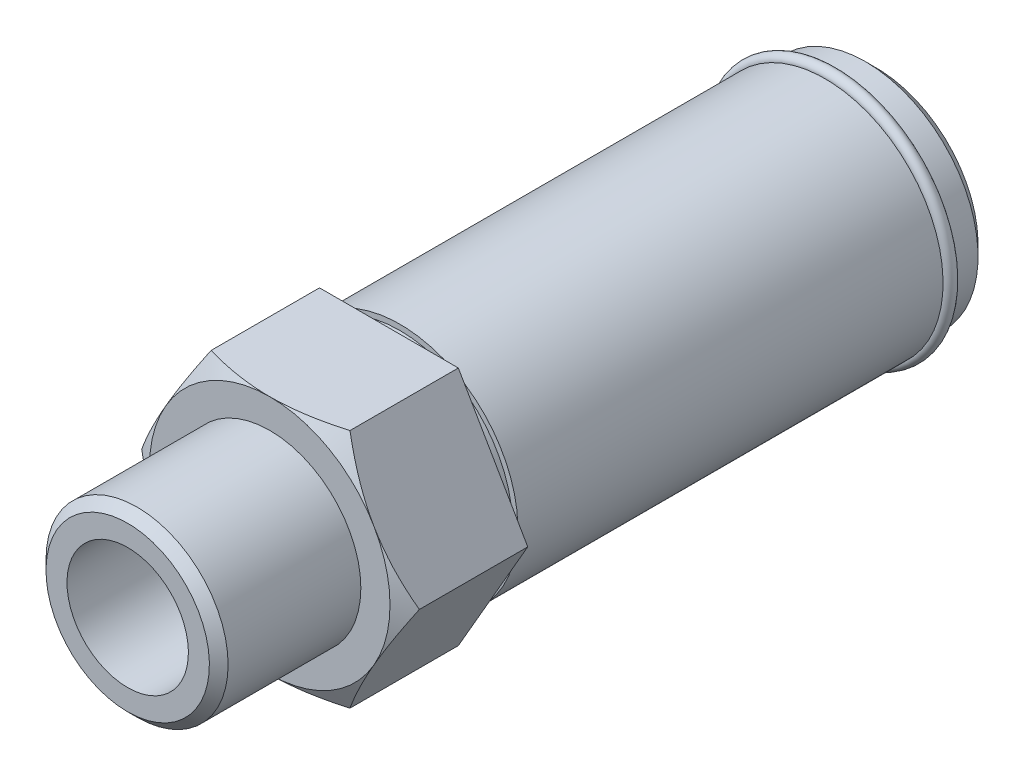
ISO-10303-21;
HEADER;
FILE_DESCRIPTION(('STEP AP214'),'2;1');
FILE_NAME('part.step','',(''),(''),'','','');
FILE_SCHEMA(('AUTOMOTIVE_DESIGN { 1 0 10303 214 1 1 1 1 }'));
ENDSEC;
DATA;
#1=APPLICATION_CONTEXT('core data for automotive mechanical design processes');
#2=APPLICATION_PROTOCOL_DEFINITION('international standard','automotive_design',2000,#1);
#3=PRODUCT_CONTEXT('',#1,'mechanical');
#4=PRODUCT('Part','Part','',(#3));
#5=PRODUCT_RELATED_PRODUCT_CATEGORY('part','',(#4));
#6=PRODUCT_DEFINITION_FORMATION('','',#4);
#7=PRODUCT_DEFINITION_CONTEXT('part definition',#1,'design');
#8=PRODUCT_DEFINITION('design','',#6,#7);
#9=PRODUCT_DEFINITION_SHAPE('','',#8);
#10=(LENGTH_UNIT() NAMED_UNIT(*) SI_UNIT(.MILLI.,.METRE.));
#11=(NAMED_UNIT(*) PLANE_ANGLE_UNIT() SI_UNIT($,.RADIAN.));
#12=(NAMED_UNIT(*) SI_UNIT($,.STERADIAN.) SOLID_ANGLE_UNIT());
#13=UNCERTAINTY_MEASURE_WITH_UNIT(LENGTH_MEASURE(1.E-05),#10,'distance_accuracy_value','');
#14=(GEOMETRIC_REPRESENTATION_CONTEXT(3) GLOBAL_UNCERTAINTY_ASSIGNED_CONTEXT((#13)) GLOBAL_UNIT_ASSIGNED_CONTEXT((#10,
#11,#12)) REPRESENTATION_CONTEXT('',''));
#15=CARTESIAN_POINT('',(0.,0.,0.));
#16=DIRECTION('',(0.,0.,1.));
#17=DIRECTION('',(1.,0.,0.));
#18=AXIS2_PLACEMENT_3D('',#15,#16,#17);
#19=CARTESIAN_POINT('',(0.,22.,41.));
#20=DIRECTION('',(0.,0.,1.));
#21=DIRECTION('',(0.,-1.,0.));
#22=AXIS2_PLACEMENT_3D('',#19,#20,#21);
#23=PLANE('',#22);
#24=CARTESIAN_POINT('',(0.,0.,41.));
#25=DIRECTION('',(0.,0.,1.));
#26=DIRECTION('',(0.,-1.,0.));
#27=AXIS2_PLACEMENT_3D('',#24,#25,#26);
#28=CIRCLE('',#27,10.3);
#29=CARTESIAN_POINT('',(0.,-10.3,41.));
#30=VERTEX_POINT('',#29);
#31=EDGE_CURVE('E229',#30,#30,#28,.T.);
#32=ORIENTED_EDGE('',*,*,#31,.T.);
#33=EDGE_LOOP('',(#32));
#34=FACE_BOUND('',#33,.T.);
#35=DIRECTION('',(1.,0.,0.));
#36=VECTOR('',#35,1.);
#37=CARTESIAN_POINT('',(-6.35085296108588,-11.,41.));
#38=LINE('',#37,#36);
#39=CARTESIAN_POINT('',(-6.35085296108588,-11.,41.));
#40=VERTEX_POINT('',#39);
#41=CARTESIAN_POINT('',(6.35085296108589,-11.,41.));
#42=VERTEX_POINT('',#41);
#43=EDGE_CURVE('E62',#40,#42,#38,.T.);
#44=ORIENTED_EDGE('',*,*,#43,.F.);
#45=DIRECTION('',(0.5,-0.866025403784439,0.));
#46=VECTOR('',#45,1.);
#47=CARTESIAN_POINT('',(-12.7017059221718,0.,41.));
#48=LINE('',#47,#46);
#49=CARTESIAN_POINT('',(-12.7017059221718,0.,41.));
#50=VERTEX_POINT('',#49);
#51=EDGE_CURVE('E138',#50,#40,#48,.T.);
#52=ORIENTED_EDGE('',*,*,#51,.F.);
#53=DIRECTION('',(-0.5,-0.866025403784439,0.));
#54=VECTOR('',#53,1.);
#55=CARTESIAN_POINT('',(-6.35085296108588,11.,41.));
#56=LINE('',#55,#54);
#57=CARTESIAN_POINT('',(-6.35085296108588,11.,41.));
#58=VERTEX_POINT('',#57);
#59=EDGE_CURVE('E136',#58,#50,#56,.T.);
#60=ORIENTED_EDGE('',*,*,#59,.F.);
#61=DIRECTION('',(-1.,0.,0.));
#62=VECTOR('',#61,1.);
#63=CARTESIAN_POINT('',(6.35085296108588,11.,41.));
#64=LINE('',#63,#62);
#65=CARTESIAN_POINT('',(6.35085296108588,11.,41.));
#66=VERTEX_POINT('',#65);
#67=EDGE_CURVE('E117',#66,#58,#64,.T.);
#68=ORIENTED_EDGE('',*,*,#67,.F.);
#69=DIRECTION('',(-0.5,0.866025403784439,0.));
#70=VECTOR('',#69,1.);
#71=CARTESIAN_POINT('',(12.7017059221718,0.,41.));
#72=LINE('',#71,#70);
#73=CARTESIAN_POINT('',(12.7017059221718,0.,41.));
#74=VERTEX_POINT('',#73);
#75=EDGE_CURVE('E127',#74,#66,#72,.T.);
#76=ORIENTED_EDGE('',*,*,#75,.F.);
#77=DIRECTION('',(0.5,0.866025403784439,0.));
#78=VECTOR('',#77,1.);
#79=CARTESIAN_POINT('',(6.35085296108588,-11.,41.));
#80=LINE('',#79,#78);
#81=EDGE_CURVE('E132',#42,#74,#80,.T.);
#82=ORIENTED_EDGE('',*,*,#81,.F.);
#83=EDGE_LOOP('',(#44,#52,#60,#68,#76,#82));
#84=FACE_BOUND('',#83,.T.);
#85=ADVANCED_FACE('F39',(#34,#84),#23,.F.);
#86=CARTESIAN_POINT('',(0.,0.,-3.59999999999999));
#87=DIRECTION('',(0.,0.,1.));
#88=DIRECTION('',(0.,-1.,0.));
#89=AXIS2_PLACEMENT_3D('',#86,#87,#88);
#90=CYLINDRICAL_SURFACE('',#89,10.3);
#91=ORIENTED_EDGE('',*,*,#31,.F.);
#92=EDGE_LOOP('',(#91));
#93=FACE_BOUND('',#92,.T.);
#94=CARTESIAN_POINT('',(0.,0.,40.));
#95=DIRECTION('',(0.,0.,1.));
#96=DIRECTION('',(0.,-1.,0.));
#97=AXIS2_PLACEMENT_3D('',#94,#95,#96);
#98=CIRCLE('',#97,10.3);
#99=CARTESIAN_POINT('',(0.,-10.3,40.));
#100=VERTEX_POINT('',#99);
#101=EDGE_CURVE('E226',#100,#100,#98,.T.);
#102=ORIENTED_EDGE('',*,*,#101,.T.);
#103=EDGE_LOOP('',(#102));
#104=FACE_BOUND('',#103,.T.);
#105=ADVANCED_FACE('F326',(#93,#104),#90,.T.);
#106=CARTESIAN_POINT('',(0.,10.3,40.));
#107=DIRECTION('',(0.,0.,-1.));
#108=DIRECTION('',(0.,1.,0.));
#109=AXIS2_PLACEMENT_3D('',#106,#107,#108);
#110=PLANE('',#109);
#111=ORIENTED_EDGE('',*,*,#101,.F.);
#112=EDGE_LOOP('',(#111));
#113=FACE_BOUND('',#112,.T.);
#114=CARTESIAN_POINT('',(0.,0.,40.));
#115=DIRECTION('',(0.,0.,1.));
#116=DIRECTION('',(0.,-1.,0.));
#117=AXIS2_PLACEMENT_3D('',#114,#115,#116);
#118=CIRCLE('',#117,10.8);
#119=CARTESIAN_POINT('',(0.,-10.8,40.));
#120=VERTEX_POINT('',#119);
#121=EDGE_CURVE('E223',#120,#120,#118,.T.);
#122=ORIENTED_EDGE('',*,*,#121,.T.);
#123=EDGE_LOOP('',(#122));
#124=FACE_BOUND('',#123,.T.);
#125=ADVANCED_FACE('F331',(#113,#124),#110,.F.);
#126=CARTESIAN_POINT('',(0.,0.,-3.59999999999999));
#127=DIRECTION('',(0.,0.,1.));
#128=DIRECTION('',(0.,-1.,0.));
#129=AXIS2_PLACEMENT_3D('',#126,#127,#128);
#130=CYLINDRICAL_SURFACE('',#129,10.8);
#131=ORIENTED_EDGE('',*,*,#121,.F.);
#132=EDGE_LOOP('',(#131));
#133=FACE_BOUND('',#132,.T.);
#134=CARTESIAN_POINT('',(0.,0.,1.09963624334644));
#135=DIRECTION('',(0.,0.,1.));
#136=DIRECTION('',(0.,-1.,0.));
#137=AXIS2_PLACEMENT_3D('',#134,#135,#136);
#138=CIRCLE('',#137,10.8);
#139=CARTESIAN_POINT('',(0.,-10.8,1.09963624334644));
#140=VERTEX_POINT('',#139);
#141=EDGE_CURVE('E220',#140,#140,#138,.T.);
#142=ORIENTED_EDGE('',*,*,#141,.T.);
#143=EDGE_LOOP('',(#142));
#144=FACE_BOUND('',#143,.T.);
#145=ADVANCED_FACE('F337',(#133,#144),#130,.T.);
#146=CARTESIAN_POINT('',(0.,0.,0.549999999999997));
#147=DIRECTION('',(0.,0.,1.));
#148=DIRECTION('',(0.,-1.,0.));
#149=AXIS2_PLACEMENT_3D('',#146,#147,#148);
#150=TOROIDAL_SURFACE('',#149,10.8200000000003,0.55);
#151=ORIENTED_EDGE('',*,*,#141,.F.);
#152=EDGE_LOOP('',(#151));
#153=FACE_BOUND('',#152,.T.);
#154=CARTESIAN_POINT('',(0.,0.,0.));
#155=DIRECTION('',(0.,0.,1.));
#156=DIRECTION('',(0.,-1.,0.));
#157=AXIS2_PLACEMENT_3D('',#154,#155,#156);
#158=CIRCLE('',#157,10.82);
#159=CARTESIAN_POINT('',(0.,-10.82,0.));
#160=VERTEX_POINT('',#159);
#161=EDGE_CURVE('E217',#160,#160,#158,.T.);
#162=ORIENTED_EDGE('',*,*,#161,.T.);
#163=EDGE_LOOP('',(#162));
#164=FACE_BOUND('',#163,.T.);
#165=ADVANCED_FACE('F341',(#153,#164),#150,.T.);
#166=CARTESIAN_POINT('',(0.,10.82,0.));
#167=DIRECTION('',(0.,0.,1.));
#168=DIRECTION('',(0.,-1.,0.));
#169=AXIS2_PLACEMENT_3D('',#166,#167,#168);
#170=PLANE('',#169);
#171=ORIENTED_EDGE('',*,*,#161,.F.);
#172=EDGE_LOOP('',(#171));
#173=FACE_BOUND('',#172,.T.);
#174=CARTESIAN_POINT('',(0.,0.,0.));
#175=DIRECTION('',(0.,0.,1.));
#176=DIRECTION('',(0.,-1.,0.));
#177=AXIS2_PLACEMENT_3D('',#174,#175,#176);
#178=CIRCLE('',#177,10.3);
#179=CARTESIAN_POINT('',(0.,-10.3,0.));
#180=VERTEX_POINT('',#179);
#181=EDGE_CURVE('E214',#180,#180,#178,.T.);
#182=ORIENTED_EDGE('',*,*,#181,.T.);
#183=EDGE_LOOP('',(#182));
#184=FACE_BOUND('',#183,.T.);
#185=ADVANCED_FACE('F345',(#173,#184),#170,.F.);
#186=CARTESIAN_POINT('',(0.,0.,-3.59999999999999));
#187=DIRECTION('',(0.,0.,1.));
#188=DIRECTION('',(0.,-1.,0.));
#189=AXIS2_PLACEMENT_3D('',#186,#187,#188);
#190=CYLINDRICAL_SURFACE('',#189,10.3);
#191=ORIENTED_EDGE('',*,*,#181,.F.);
#192=EDGE_LOOP('',(#191));
#193=FACE_BOUND('',#192,.T.);
#194=CARTESIAN_POINT('',(0.,0.,-2.6));
#195=DIRECTION('',(0.,0.,1.));
#196=DIRECTION('',(0.,-1.,0.));
#197=AXIS2_PLACEMENT_3D('',#194,#195,#196);
#198=CIRCLE('',#197,10.3);
#199=CARTESIAN_POINT('',(0.,-10.3,-2.6));
#200=VERTEX_POINT('',#199);
#201=EDGE_CURVE('E211',#200,#200,#198,.T.);
#202=ORIENTED_EDGE('',*,*,#201,.T.);
#203=EDGE_LOOP('',(#202));
#204=FACE_BOUND('',#203,.T.);
#205=ADVANCED_FACE('F349',(#193,#204),#190,.T.);
#206=CARTESIAN_POINT('',(0.,0.,-3.6));
#207=DIRECTION('',(0.,0.,1.));
#208=DIRECTION('',(0.,-1.,0.));
#209=AXIS2_PLACEMENT_3D('',#206,#207,#208);
#210=CONICAL_SURFACE('',#209,9.3,0.785398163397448);
#211=ORIENTED_EDGE('',*,*,#201,.F.);
#212=EDGE_LOOP('',(#211));
#213=FACE_BOUND('',#212,.T.);
#214=CARTESIAN_POINT('',(0.,0.,-3.6));
#215=DIRECTION('',(0.,0.,1.));
#216=DIRECTION('',(0.,-1.,0.));
#217=AXIS2_PLACEMENT_3D('',#214,#215,#216);
#218=CIRCLE('',#217,9.3);
#219=CARTESIAN_POINT('',(0.,-9.3,-3.6));
#220=VERTEX_POINT('',#219);
#221=EDGE_CURVE('E208',#220,#220,#218,.T.);
#222=ORIENTED_EDGE('',*,*,#221,.T.);
#223=EDGE_LOOP('',(#222));
#224=FACE_BOUND('',#223,.T.);
#225=ADVANCED_FACE('F353',(#213,#224),#210,.T.);
#226=CARTESIAN_POINT('',(0.,9.3,-3.59999999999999));
#227=DIRECTION('',(0.,0.,1.));
#228=DIRECTION('',(0.,-1.,0.));
#229=AXIS2_PLACEMENT_3D('',#226,#227,#228);
#230=PLANE('',#229);
#231=ORIENTED_EDGE('',*,*,#221,.F.);
#232=EDGE_LOOP('',(#231));
#233=FACE_BOUND('',#232,.T.);
#234=CARTESIAN_POINT('',(0.,0.,-3.6));
#235=DIRECTION('',(0.,0.,1.));
#236=DIRECTION('',(0.,-1.,0.));
#237=AXIS2_PLACEMENT_3D('',#234,#235,#236);
#238=CIRCLE('',#237,8.331);
#239=CARTESIAN_POINT('',(0.,-8.331,-3.6));
#240=VERTEX_POINT('',#239);
#241=EDGE_CURVE('E205',#240,#240,#238,.T.);
#242=ORIENTED_EDGE('',*,*,#241,.T.);
#243=EDGE_LOOP('',(#242));
#244=FACE_BOUND('',#243,.T.);
#245=ADVANCED_FACE('F357',(#233,#244),#230,.F.);
#246=CARTESIAN_POINT('',(0.,0.,-2.744));
#247=DIRECTION('',(0.,0.,-1.));
#248=DIRECTION('',(0.,1.,0.));
#249=AXIS2_PLACEMENT_3D('',#246,#247,#248);
#250=CONICAL_SURFACE('',#249,7.475,0.785398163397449);
#251=ORIENTED_EDGE('',*,*,#241,.F.);
#252=EDGE_LOOP('',(#251));
#253=FACE_BOUND('',#252,.T.);
#254=CARTESIAN_POINT('',(0.,0.,-2.744));
#255=DIRECTION('',(0.,0.,1.));
#256=DIRECTION('',(0.,-1.,0.));
#257=AXIS2_PLACEMENT_3D('',#254,#255,#256);
#258=CIRCLE('',#257,7.475);
#259=CARTESIAN_POINT('',(0.,-7.475,-2.744));
#260=VERTEX_POINT('',#259);
#261=EDGE_CURVE('E202',#260,#260,#258,.T.);
#262=ORIENTED_EDGE('',*,*,#261,.T.);
#263=EDGE_LOOP('',(#262));
#264=FACE_BOUND('',#263,.T.);
#265=ADVANCED_FACE('F361',(#253,#264),#250,.F.);
#266=CARTESIAN_POINT('',(0.,0.,-3.59999999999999));
#267=DIRECTION('',(0.,0.,1.));
#268=DIRECTION('',(0.,-1.,0.));
#269=AXIS2_PLACEMENT_3D('',#266,#267,#268);
#270=CYLINDRICAL_SURFACE('',#269,7.475);
#271=ORIENTED_EDGE('',*,*,#261,.F.);
#272=EDGE_LOOP('',(#271));
#273=FACE_BOUND('',#272,.T.);
#274=CARTESIAN_POINT('',(0.,0.,9.3));
#275=DIRECTION('',(0.,0.,1.));
#276=DIRECTION('',(0.,-1.,0.));
#277=AXIS2_PLACEMENT_3D('',#274,#275,#276);
#278=CIRCLE('',#277,7.475);
#279=CARTESIAN_POINT('',(0.,-7.475,9.3));
#280=VERTEX_POINT('',#279);
#281=EDGE_CURVE('E199',#280,#280,#278,.T.);
#282=ORIENTED_EDGE('',*,*,#281,.T.);
#283=EDGE_LOOP('',(#282));
#284=FACE_BOUND('',#283,.T.);
#285=ADVANCED_FACE('F364',(#273,#284),#270,.F.);
#286=CARTESIAN_POINT('',(0.,7.475,9.30000000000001));
#287=DIRECTION('',(0.,0.,1.));
#288=DIRECTION('',(0.,-1.,0.));
#289=AXIS2_PLACEMENT_3D('',#286,#287,#288);
#290=PLANE('',#289);
#291=ORIENTED_EDGE('',*,*,#281,.F.);
#292=EDGE_LOOP('',(#291));
#293=FACE_BOUND('',#292,.T.);
#294=ADVANCED_FACE('F182',(#293),#290,.F.);
#295=CARTESIAN_POINT('',(-6.35085296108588,-11.,41.));
#296=DIRECTION('',(0.,-1.,0.));
#297=DIRECTION('',(0.,0.,-1.));
#298=AXIS2_PLACEMENT_3D('',#295,#296,#297);
#299=PLANE('',#298);
#300=CARTESIAN_POINT('',(-17.1494700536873,-11.,46.4878555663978));
#301=CARTESIAN_POINT('',(-16.9088416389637,-11.,46.6047919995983));
#302=CARTESIAN_POINT('',(-16.6679332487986,-11.,46.7211520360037));
#303=CARTESIAN_POINT('',(-16.1854981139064,-11.,46.9525889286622));
#304=CARTESIAN_POINT('',(-15.9439713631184,-11.,47.0676657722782));
#305=CARTESIAN_POINT('',(-15.2183128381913,-11.,47.4108057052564));
#306=CARTESIAN_POINT('',(-14.733172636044,-11.,47.6367441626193));
#307=CARTESIAN_POINT('',(-13.7570787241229,-11.,48.0828025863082));
#308=CARTESIAN_POINT('',(-13.2661077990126,-11.,48.3028849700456));
#309=CARTESIAN_POINT('',(-12.2802921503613,-11.,48.7341645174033));
#310=CARTESIAN_POINT('',(-11.7854476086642,-11.,48.9453620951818));
#311=CARTESIAN_POINT('',(-10.7749198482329,-11.,49.3632128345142));
#312=CARTESIAN_POINT('',(-10.2590823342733,-11.,49.5694947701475));
#313=CARTESIAN_POINT('',(-9.22140262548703,-11.,49.9666647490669));
#314=CARTESIAN_POINT('',(-8.69955976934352,-11.,50.1575510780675));
#315=CARTESIAN_POINT('',(-7.65000312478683,-11.,50.5189828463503));
#316=CARTESIAN_POINT('',(-7.12230334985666,-11.,50.6895686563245));
#317=CARTESIAN_POINT('',(-6.05928576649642,-11.,51.0049960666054));
#318=CARTESIAN_POINT('',(-5.52397038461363,-11.,51.1498456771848));
#319=CARTESIAN_POINT('',(-4.71663342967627,-11.,51.3422340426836));
#320=CARTESIAN_POINT('',(-4.44752912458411,-11.,51.4020869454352));
#321=CARTESIAN_POINT('',(-3.90746509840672,-11.,51.5127879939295));
#322=CARTESIAN_POINT('',(-3.63650541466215,-11.,51.5636363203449));
#323=CARTESIAN_POINT('',(-3.09291179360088,-11.,51.6554361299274));
#324=CARTESIAN_POINT('',(-2.82027788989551,-11.,51.6963878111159));
#325=CARTESIAN_POINT('',(-2.27361639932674,-11.,51.7675811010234));
#326=CARTESIAN_POINT('',(-1.99958886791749,-11.,51.797823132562));
#327=CARTESIAN_POINT('',(-1.45414258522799,-11.,51.8466118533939));
#328=CARTESIAN_POINT('',(-1.18273728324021,-11.,51.8653079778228));
#329=CARTESIAN_POINT('',(-0.639379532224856,-11.,51.8912013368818));
#330=CARTESIAN_POINT('',(-0.367427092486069,-11.,51.8983987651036));
#331=CARTESIAN_POINT('',(0.176540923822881,-11.,51.9011231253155));
#332=CARTESIAN_POINT('',(0.448556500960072,-11.,51.8966499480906));
#333=CARTESIAN_POINT('',(0.992154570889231,-11.,51.8761433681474));
#334=CARTESIAN_POINT('',(1.26373704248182,-11.,51.8601094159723));
#335=CARTESIAN_POINT('',(1.91358960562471,-11.,51.8082526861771));
#336=CARTESIAN_POINT('',(2.29144383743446,-11.,51.7671029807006));
#337=CARTESIAN_POINT('',(3.04439020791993,-11.,51.664648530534));
#338=CARTESIAN_POINT('',(3.41948197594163,-11.,51.6033411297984));
#339=CARTESIAN_POINT('',(4.54015051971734,-11.,51.3924298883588));
#340=CARTESIAN_POINT('',(5.28072413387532,-11.,51.2158728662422));
#341=CARTESIAN_POINT('',(6.38844541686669,-11.,50.9091026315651));
#342=CARTESIAN_POINT('',(6.76131876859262,-11.,50.7983711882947));
#343=CARTESIAN_POINT('',(7.50344393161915,-11.,50.5652651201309));
#344=CARTESIAN_POINT('',(7.87269571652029,-11.,50.4428904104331));
#345=CARTESIAN_POINT('',(8.60769467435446,-11.,50.1884734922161));
#346=CARTESIAN_POINT('',(8.97344289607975,-11.,50.0564342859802));
#347=CARTESIAN_POINT('',(9.7018957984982,-11.,49.7842565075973));
#348=CARTESIAN_POINT('',(10.064600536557,-11.,49.6441180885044));
#349=CARTESIAN_POINT('',(11.0027637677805,-11.,49.2715225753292));
#350=CARTESIAN_POINT('',(11.5761433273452,-11.,49.0338371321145));
#351=CARTESIAN_POINT('',(12.7173509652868,-11.,48.5454494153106));
#352=CARTESIAN_POINT('',(13.2851785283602,-11.,48.2947459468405));
#353=CARTESIAN_POINT('',(14.4164848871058,-11.,47.7832633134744));
#354=CARTESIAN_POINT('',(14.9799622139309,-11.,47.52248090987));
#355=CARTESIAN_POINT('',(16.1032173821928,-11.,46.9931380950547));
#356=CARTESIAN_POINT('',(16.6629953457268,-11.,46.724577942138));
#357=CARTESIAN_POINT('',(17.7803426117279,-11.,46.1809169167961));
#358=CARTESIAN_POINT('',(18.3379076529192,-11.,45.9058073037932));
#359=CARTESIAN_POINT('',(19.4505702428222,-11.,45.3506412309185));
#360=CARTESIAN_POINT('',(20.0056677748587,-11.,45.0705847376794));
#361=CARTESIAN_POINT('',(21.1137147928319,-11.,44.5065127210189));
#362=CARTESIAN_POINT('',(21.6666646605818,-11.,44.2224979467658));
#363=CARTESIAN_POINT('',(22.7708591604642,-11.,43.6511708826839));
#364=CARTESIAN_POINT('',(23.3221037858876,-11.,43.3638585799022));
#365=CARTESIAN_POINT('',(24.8650092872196,-11.,42.5548287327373));
#366=CARTESIAN_POINT('',(25.8550645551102,-11.,42.0300495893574));
#367=CARTESIAN_POINT('',(27.8317717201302,-11.,40.9740126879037));
#368=CARTESIAN_POINT('',(28.8184234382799,-11.,40.4427545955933));
#369=CARTESIAN_POINT('',(30.786100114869,-11.,39.3769883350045));
#370=CARTESIAN_POINT('',(31.7671330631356,-11.,38.84249490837));
#371=CARTESIAN_POINT('',(33.237114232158,-11.,38.0379728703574));
#372=CARTESIAN_POINT('',(33.7268298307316,-11.,37.7693444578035));
#373=CARTESIAN_POINT('',(34.7058031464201,-11.,37.2312560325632));
#374=CARTESIAN_POINT('',(35.1950608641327,-11.,36.9617960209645));
#375=CARTESIAN_POINT('',(35.6841170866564,-11.,36.6919707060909));
#376=B_SPLINE_CURVE_WITH_KNOTS('',3,(#300,#301,#302,#303,#304,#305,#306,#307,#308,#309,#310,
#311,#312,#313,#314,#315,#316,#317,#318,#319,#320,#321,#322,#323,#324,#325,#326,#327,#328,#329,
#330,#331,#332,#333,#334,#335,#336,#337,#338,#339,#340,#341,#342,#343,#344,#345,#346,#347,#348,
#349,#350,#351,#352,#353,#354,#355,#356,#357,#358,#359,#360,#361,#362,#363,#364,#365,#366,#367,
#368,#369,#370,#371,#372,#373,#374,#375),.UNSPECIFIED.,.F.,.F.,(4,2,2,2,2,2,2,2,2,2,2,2,2,2,2,2,
2,2,2,2,2,2,2,2,2,2,2,2,2,2,2,2,2,2,2,2,2,4),(0.,0.802610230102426,1.60522835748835,
3.21069768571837,4.82475368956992,6.43873437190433,8.10520960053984,9.7718701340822,
11.4351588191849,13.0979289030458,13.9248428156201,14.7517401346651,15.5786209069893,
16.4054690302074,17.221378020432,18.0372732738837,18.8531761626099,19.6691178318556,
20.8087410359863,21.9485144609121,24.2292499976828,25.3960537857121,26.5628660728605,
27.7293174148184,28.8957467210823,30.7575890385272,32.6196025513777,34.4822194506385,
36.3447745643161,38.2099726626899,40.0751833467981,41.9400456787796,43.8049153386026,
47.166488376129,50.5282355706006,53.8797881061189,55.5554495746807,57.2311088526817),.UNSPECIFIED.);
#377=CARTESIAN_POINT('',(6.35085296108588,-11.,50.9175196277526));
#378=VERTEX_POINT('',#377);
#379=CARTESIAN_POINT('',(0.,-11.,51.9));
#380=VERTEX_POINT('',#379);
#381=EDGE_CURVE('E191',#378,#380,#376,.F.);
#382=ORIENTED_EDGE('',*,*,#381,.T.);
#383=CARTESIAN_POINT('',(-6.35085296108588,-11.,50.9175196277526));
#384=VERTEX_POINT('',#383);
#385=EDGE_CURVE('E185',#380,#384,#376,.F.);
#386=ORIENTED_EDGE('',*,*,#385,.T.);
#387=DIRECTION('',(0.,0.,1.));
#388=VECTOR('',#387,1.);
#389=CARTESIAN_POINT('',(-6.35085296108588,-11.,41.));
#390=LINE('',#389,#388);
#391=EDGE_CURVE('E145',#40,#384,#390,.T.);
#392=ORIENTED_EDGE('',*,*,#391,.F.);
#393=ORIENTED_EDGE('',*,*,#43,.T.);
#394=DIRECTION('',(0.,0.,1.));
#395=VECTOR('',#394,1.);
#396=CARTESIAN_POINT('',(6.35085296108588,-11.,41.));
#397=LINE('',#396,#395);
#398=EDGE_CURVE('E144',#42,#378,#397,.T.);
#399=ORIENTED_EDGE('',*,*,#398,.T.);
#400=EDGE_LOOP('',(#382,#386,#392,#393,#399));
#401=FACE_BOUND('',#400,.T.);
#402=ADVANCED_FACE('F177',(#401),#299,.T.);
#403=CARTESIAN_POINT('',(-12.7017059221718,0.,41.));
#404=DIRECTION('',(-0.866025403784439,-0.5,0.));
#405=DIRECTION('',(0.5,-0.866025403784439,0.));
#406=AXIS2_PLACEMENT_3D('',#403,#404,#405);
#407=PLANE('',#406);
#408=CARTESIAN_POINT('',(-6.35073749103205,-11.0002,50.9174529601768));
#409=CARTESIAN_POINT('',(-6.49034297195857,-10.7583962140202,50.9980408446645));
#410=CARTESIAN_POINT('',(-6.63046897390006,-10.515690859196,51.0749710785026));
#411=CARTESIAN_POINT('',(-6.91184468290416,-10.0283338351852,51.2205013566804));
#412=CARTESIAN_POINT('',(-7.05309474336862,-9.78368155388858,51.2890986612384));
#413=CARTESIAN_POINT('',(-7.47912088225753,-9.0457826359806,51.4810636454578));
#414=CARTESIAN_POINT('',(-7.7655787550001,-8.54962304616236,51.5902522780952));
#415=CARTESIAN_POINT('',(-8.19424982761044,-7.80714296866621,51.7182858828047));
#416=CARTESIAN_POINT('',(-8.33518236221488,-7.56304065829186,51.7547577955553));
#417=CARTESIAN_POINT('',(-8.61769996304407,-7.07370581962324,51.815918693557));
#418=CARTESIAN_POINT('',(-8.75928504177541,-6.82847326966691,51.8406074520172));
#419=CARTESIAN_POINT('',(-9.04269125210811,-6.33759931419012,51.8775696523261));
#420=CARTESIAN_POINT('',(-9.18451190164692,-6.09195874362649,51.8898578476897));
#421=CARTESIAN_POINT('',(-9.468284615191,-5.60044998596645,51.9017570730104));
#422=CARTESIAN_POINT('',(-9.61023667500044,-5.35458180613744,51.9013684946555));
#423=CARTESIAN_POINT('',(-9.87561687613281,-4.89492981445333,51.8887988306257));
#424=CARTESIAN_POINT('',(-9.99906394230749,-4.68111322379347,51.8781509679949));
#425=CARTESIAN_POINT('',(-10.2456741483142,-4.25397181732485,51.8474683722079));
#426=CARTESIAN_POINT('',(-10.3688372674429,-4.04064703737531,51.8274329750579));
#427=CARTESIAN_POINT('',(-10.6148126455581,-3.6146051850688,51.7783246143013));
#428=CARTESIAN_POINT('',(-10.7376245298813,-3.4018887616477,51.749244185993));
#429=CARTESIAN_POINT('',(-10.9826725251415,-2.97745318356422,51.6825560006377));
#430=CARTESIAN_POINT('',(-11.1049085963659,-2.76573409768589,51.6449476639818));
#431=CARTESIAN_POINT('',(-11.4759630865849,-2.12304886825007,51.5183800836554));
#432=CARTESIAN_POINT('',(-11.7237069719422,-1.69394387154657,51.4168005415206));
#433=CARTESIAN_POINT('',(-12.2155005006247,-0.842132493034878,51.1862563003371));
#434=CARTESIAN_POINT('',(-12.4595564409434,-0.419415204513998,51.0573457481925));
#435=CARTESIAN_POINT('',(-12.7018213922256,0.000199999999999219,50.9174529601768));
#436=B_SPLINE_CURVE_WITH_KNOTS('',3,(#408,#409,#410,#411,#412,#413,#414,#415,#416,#417,#418,
#419,#420,#421,#422,#423,#424,#425,#426,#427,#428,#429,#430,#431,#432,#433,#434,#435),
.UNSPECIFIED.,.F.,.F.,(4,2,2,2,2,2,2,2,2,2,2,2,2,4),(0.,0.871755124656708,1.74379610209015,
3.49159027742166,4.34403665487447,5.19649943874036,6.0479468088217,6.89936787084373,
7.64056020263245,8.38180496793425,9.1236630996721,9.86557166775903,11.3820155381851,
12.8954827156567),.UNSPECIFIED.);
#437=CARTESIAN_POINT('',(-9.52627944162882,-5.5,51.9));
#438=VERTEX_POINT('',#437);
#439=EDGE_CURVE('E192',#384,#438,#436,.T.);
#440=ORIENTED_EDGE('',*,*,#439,.T.);
#441=CARTESIAN_POINT('',(-12.7017059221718,0.,50.9175196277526));
#442=VERTEX_POINT('',#441);
#443=EDGE_CURVE('E193',#438,#442,#436,.T.);
#444=ORIENTED_EDGE('',*,*,#443,.T.);
#445=DIRECTION('',(0.,0.,1.));
#446=VECTOR('',#445,1.);
#447=CARTESIAN_POINT('',(-12.7017059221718,0.,41.));
#448=LINE('',#447,#446);
#449=EDGE_CURVE('E149',#50,#442,#448,.T.);
#450=ORIENTED_EDGE('',*,*,#449,.F.);
#451=ORIENTED_EDGE('',*,*,#51,.T.);
#452=ORIENTED_EDGE('',*,*,#391,.T.);
#453=EDGE_LOOP('',(#440,#444,#450,#451,#452));
#454=FACE_BOUND('',#453,.T.);
#455=ADVANCED_FACE('F181',(#454),#407,.T.);
#456=CARTESIAN_POINT('',(-6.35085296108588,11.,41.));
#457=DIRECTION('',(-0.866025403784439,0.5,0.));
#458=DIRECTION('',(-0.5,-0.866025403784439,0.));
#459=AXIS2_PLACEMENT_3D('',#456,#457,#458);
#460=PLANE('',#459);
#461=CARTESIAN_POINT('',(-12.7018213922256,-0.00020000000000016,50.9174529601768));
#462=CARTESIAN_POINT('',(-12.5622159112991,0.241603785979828,50.9980408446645));
#463=CARTESIAN_POINT('',(-12.4220899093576,0.484309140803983,51.0749710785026));
#464=CARTESIAN_POINT('',(-12.1407142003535,0.971666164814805,51.2205013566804));
#465=CARTESIAN_POINT('',(-11.999464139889,1.21631844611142,51.2890986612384));
#466=CARTESIAN_POINT('',(-11.5734380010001,1.9542173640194,51.4810636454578));
#467=CARTESIAN_POINT('',(-11.2869801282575,2.45037695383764,51.5902522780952));
#468=CARTESIAN_POINT('',(-10.8583090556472,3.19285703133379,51.7182858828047));
#469=CARTESIAN_POINT('',(-10.7173765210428,3.43695934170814,51.7547577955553));
#470=CARTESIAN_POINT('',(-10.4348589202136,3.92629418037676,51.815918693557));
#471=CARTESIAN_POINT('',(-10.2932738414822,4.17152673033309,51.8406074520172));
#472=CARTESIAN_POINT('',(-10.0098676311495,4.66240068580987,51.8775696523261));
#473=CARTESIAN_POINT('',(-9.86804698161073,4.9080412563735,51.8898578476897));
#474=CARTESIAN_POINT('',(-9.58427426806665,5.39955001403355,51.9017570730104));
#475=CARTESIAN_POINT('',(-9.44232220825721,5.64541819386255,51.9013684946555));
#476=CARTESIAN_POINT('',(-9.17694200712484,6.10507018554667,51.8887988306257));
#477=CARTESIAN_POINT('',(-9.05349494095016,6.31888677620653,51.8781509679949));
#478=CARTESIAN_POINT('',(-8.80688473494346,6.74602818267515,51.8474683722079));
#479=CARTESIAN_POINT('',(-8.68372161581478,6.95935296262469,51.8274329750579));
#480=CARTESIAN_POINT('',(-8.43774623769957,7.3853948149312,51.7783246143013));
#481=CARTESIAN_POINT('',(-8.31493435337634,7.5981112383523,51.749244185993));
#482=CARTESIAN_POINT('',(-8.06988635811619,8.02254681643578,51.6825560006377));
#483=CARTESIAN_POINT('',(-7.94765028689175,8.23426590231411,51.6449476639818));
#484=CARTESIAN_POINT('',(-7.57659579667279,8.87695113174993,51.5183800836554));
#485=CARTESIAN_POINT('',(-7.32885191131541,9.30605612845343,51.4168005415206));
#486=CARTESIAN_POINT('',(-6.8370583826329,10.1578675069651,51.1862563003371));
#487=CARTESIAN_POINT('',(-6.59300244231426,10.580584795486,51.0573457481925));
#488=CARTESIAN_POINT('',(-6.35073749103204,11.0002,50.9174529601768));
#489=B_SPLINE_CURVE_WITH_KNOTS('',3,(#461,#462,#463,#464,#465,#466,#467,#468,#469,#470,#471,
#472,#473,#474,#475,#476,#477,#478,#479,#480,#481,#482,#483,#484,#485,#486,#487,#488),
.UNSPECIFIED.,.F.,.F.,(4,2,2,2,2,2,2,2,2,2,2,2,2,4),(0.,0.871755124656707,1.74379610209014,
3.49159027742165,4.34403665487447,5.19649943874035,6.0479468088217,6.89936787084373,
7.64056020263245,8.38180496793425,9.1236630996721,9.86557166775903,11.3820155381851,
12.8954827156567),.UNSPECIFIED.);
#490=CARTESIAN_POINT('',(-9.52627944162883,5.49999999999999,51.9));
#491=VERTEX_POINT('',#490);
#492=EDGE_CURVE('E295',#442,#491,#489,.T.);
#493=ORIENTED_EDGE('',*,*,#492,.T.);
#494=CARTESIAN_POINT('',(-6.35085296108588,11.,50.9175196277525));
#495=VERTEX_POINT('',#494);
#496=EDGE_CURVE('E304',#491,#495,#489,.T.);
#497=ORIENTED_EDGE('',*,*,#496,.T.);
#498=DIRECTION('',(0.,0.,1.));
#499=VECTOR('',#498,1.);
#500=CARTESIAN_POINT('',(-6.35085296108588,11.,41.));
#501=LINE('',#500,#499);
#502=EDGE_CURVE('E123',#58,#495,#501,.T.);
#503=ORIENTED_EDGE('',*,*,#502,.F.);
#504=ORIENTED_EDGE('',*,*,#59,.T.);
#505=ORIENTED_EDGE('',*,*,#449,.T.);
#506=EDGE_LOOP('',(#493,#497,#503,#504,#505));
#507=FACE_BOUND('',#506,.T.);
#508=ADVANCED_FACE('F302',(#507),#460,.T.);
#509=CARTESIAN_POINT('',(6.35085296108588,11.,41.));
#510=DIRECTION('',(0.,1.,0.));
#511=DIRECTION('',(0.,0.,1.));
#512=AXIS2_PLACEMENT_3D('',#509,#510,#511);
#513=PLANE('',#512);
#514=CARTESIAN_POINT('',(-17.1494700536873,11.,46.4878555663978));
#515=CARTESIAN_POINT('',(-16.9088416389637,11.,46.6047919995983));
#516=CARTESIAN_POINT('',(-16.6679332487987,11.,46.7211520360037));
#517=CARTESIAN_POINT('',(-16.1854981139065,11.,46.9525889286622));
#518=CARTESIAN_POINT('',(-15.9439713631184,11.,47.0676657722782));
#519=CARTESIAN_POINT('',(-15.2183128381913,11.,47.4108057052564));
#520=CARTESIAN_POINT('',(-14.733172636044,11.,47.6367441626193));
#521=CARTESIAN_POINT('',(-13.7570787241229,11.,48.0828025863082));
#522=CARTESIAN_POINT('',(-13.2661077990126,11.,48.3028849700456));
#523=CARTESIAN_POINT('',(-12.2802921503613,11.,48.7341645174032));
#524=CARTESIAN_POINT('',(-11.7854476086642,11.,48.9453620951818));
#525=CARTESIAN_POINT('',(-10.7749198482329,11.,49.3632128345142));
#526=CARTESIAN_POINT('',(-10.2590823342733,11.,49.5694947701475));
#527=CARTESIAN_POINT('',(-9.22140262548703,11.,49.9666647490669));
#528=CARTESIAN_POINT('',(-8.69955976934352,11.,50.1575510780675));
#529=CARTESIAN_POINT('',(-7.65000312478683,11.,50.5189828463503));
#530=CARTESIAN_POINT('',(-7.12230334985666,11.,50.6895686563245));
#531=CARTESIAN_POINT('',(-6.05928576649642,11.,51.0049960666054));
#532=CARTESIAN_POINT('',(-5.52397038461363,11.,51.1498456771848));
#533=CARTESIAN_POINT('',(-4.71663342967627,11.,51.3422340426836));
#534=CARTESIAN_POINT('',(-4.44752912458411,11.,51.4020869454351));
#535=CARTESIAN_POINT('',(-3.90746509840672,11.,51.5127879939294));
#536=CARTESIAN_POINT('',(-3.63650541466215,11.,51.5636363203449));
#537=CARTESIAN_POINT('',(-3.09291179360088,11.,51.6554361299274));
#538=CARTESIAN_POINT('',(-2.82027788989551,11.,51.6963878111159));
#539=CARTESIAN_POINT('',(-2.27361639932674,11.,51.7675811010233));
#540=CARTESIAN_POINT('',(-1.99958886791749,11.,51.797823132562));
#541=CARTESIAN_POINT('',(-1.45414258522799,11.,51.8466118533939));
#542=CARTESIAN_POINT('',(-1.18273728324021,11.,51.8653079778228));
#543=CARTESIAN_POINT('',(-0.639379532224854,11.,51.8912013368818));
#544=CARTESIAN_POINT('',(-0.367427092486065,11.,51.8983987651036));
#545=CARTESIAN_POINT('',(0.176540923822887,11.,51.9011231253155));
#546=CARTESIAN_POINT('',(0.448556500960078,11.,51.8966499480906));
#547=CARTESIAN_POINT('',(0.992154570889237,11.,51.8761433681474));
#548=CARTESIAN_POINT('',(1.26373704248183,11.,51.8601094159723));
#549=CARTESIAN_POINT('',(1.91358960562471,11.,51.808252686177));
#550=CARTESIAN_POINT('',(2.29144383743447,11.,51.7671029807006));
#551=CARTESIAN_POINT('',(3.04439020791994,11.,51.664648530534));
#552=CARTESIAN_POINT('',(3.41948197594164,11.,51.6033411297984));
#553=CARTESIAN_POINT('',(4.54015051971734,11.,51.3924298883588));
#554=CARTESIAN_POINT('',(5.28072413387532,11.,51.2158728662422));
#555=CARTESIAN_POINT('',(6.3884454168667,11.,50.909102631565));
#556=CARTESIAN_POINT('',(6.76131876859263,11.,50.7983711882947));
#557=CARTESIAN_POINT('',(7.50344393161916,11.,50.5652651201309));
#558=CARTESIAN_POINT('',(7.8726957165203,11.,50.4428904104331));
#559=CARTESIAN_POINT('',(8.60769467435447,11.,50.1884734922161));
#560=CARTESIAN_POINT('',(8.97344289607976,11.,50.0564342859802));
#561=CARTESIAN_POINT('',(9.70189579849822,11.,49.7842565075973));
#562=CARTESIAN_POINT('',(10.0646005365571,11.,49.6441180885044));
#563=CARTESIAN_POINT('',(11.0027637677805,11.,49.2715225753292));
#564=CARTESIAN_POINT('',(11.5761433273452,11.,49.0338371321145));
#565=CARTESIAN_POINT('',(12.7173509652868,11.,48.5454494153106));
#566=CARTESIAN_POINT('',(13.2851785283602,11.,48.2947459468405));
#567=CARTESIAN_POINT('',(14.4164848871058,11.,47.7832633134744));
#568=CARTESIAN_POINT('',(14.9799622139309,11.,47.52248090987));
#569=CARTESIAN_POINT('',(16.1032173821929,11.,46.9931380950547));
#570=CARTESIAN_POINT('',(16.6629953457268,11.,46.724577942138));
#571=CARTESIAN_POINT('',(17.7803426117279,11.,46.1809169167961));
#572=CARTESIAN_POINT('',(18.3379076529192,11.,45.9058073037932));
#573=CARTESIAN_POINT('',(19.4505702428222,11.,45.3506412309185));
#574=CARTESIAN_POINT('',(20.0056677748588,11.,45.0705847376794));
#575=CARTESIAN_POINT('',(21.1137147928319,11.,44.5065127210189));
#576=CARTESIAN_POINT('',(21.6666646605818,11.,44.2224979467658));
#577=CARTESIAN_POINT('',(22.7708591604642,11.,43.6511708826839));
#578=CARTESIAN_POINT('',(23.3221037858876,11.,43.3638585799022));
#579=CARTESIAN_POINT('',(24.8650092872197,11.,42.5548287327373));
#580=CARTESIAN_POINT('',(25.8550645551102,11.,42.0300495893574));
#581=CARTESIAN_POINT('',(27.8317717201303,11.,40.9740126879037));
#582=CARTESIAN_POINT('',(28.8184234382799,11.,40.4427545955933));
#583=CARTESIAN_POINT('',(30.7861001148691,11.,39.3769883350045));
#584=CARTESIAN_POINT('',(31.7671330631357,11.,38.84249490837));
#585=CARTESIAN_POINT('',(33.237114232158,11.,38.0379728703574));
#586=CARTESIAN_POINT('',(33.7268298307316,11.,37.7693444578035));
#587=CARTESIAN_POINT('',(34.7058031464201,11.,37.2312560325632));
#588=CARTESIAN_POINT('',(35.1950608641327,11.,36.9617960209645));
#589=CARTESIAN_POINT('',(35.6841170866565,11.,36.6919707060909));
#590=B_SPLINE_CURVE_WITH_KNOTS('',3,(#514,#515,#516,#517,#518,#519,#520,#521,#522,#523,#524,
#525,#526,#527,#528,#529,#530,#531,#532,#533,#534,#535,#536,#537,#538,#539,#540,#541,#542,#543,
#544,#545,#546,#547,#548,#549,#550,#551,#552,#553,#554,#555,#556,#557,#558,#559,#560,#561,#562,
#563,#564,#565,#566,#567,#568,#569,#570,#571,#572,#573,#574,#575,#576,#577,#578,#579,#580,#581,
#582,#583,#584,#585,#586,#587,#588,#589),.UNSPECIFIED.,.F.,.F.,(4,2,2,2,2,2,2,2,2,2,2,2,2,2,2,2,
2,2,2,2,2,2,2,2,2,2,2,2,2,2,2,2,2,2,2,2,2,4),(0.,0.802610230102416,1.60522835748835,
3.21069768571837,4.82475368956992,6.43873437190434,8.10520960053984,9.77187013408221,
11.435158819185,13.0979289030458,13.9248428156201,14.7517401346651,15.5786209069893,
16.4054690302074,17.221378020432,18.0372732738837,18.8531761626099,19.6691178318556,
20.8087410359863,21.9485144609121,24.2292499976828,25.3960537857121,26.5628660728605,
27.7293174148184,28.8957467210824,30.7575890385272,32.6196025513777,34.4822194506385,
36.3447745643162,38.2099726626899,40.0751833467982,41.9400456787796,43.8049153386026,
47.166488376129,50.5282355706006,53.8797881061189,55.5554495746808,57.2311088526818),.UNSPECIFIED.);
#591=CARTESIAN_POINT('',(0.,11.,51.9));
#592=VERTEX_POINT('',#591);
#593=EDGE_CURVE('E306',#495,#592,#590,.T.);
#594=ORIENTED_EDGE('',*,*,#593,.T.);
#595=CARTESIAN_POINT('',(6.35085296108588,11.,50.9175196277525));
#596=VERTEX_POINT('',#595);
#597=EDGE_CURVE('E120',#592,#596,#590,.T.);
#598=ORIENTED_EDGE('',*,*,#597,.T.);
#599=DIRECTION('',(0.,0.,1.));
#600=VECTOR('',#599,1.);
#601=CARTESIAN_POINT('',(6.35085296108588,11.,41.));
#602=LINE('',#601,#600);
#603=EDGE_CURVE('E112',#66,#596,#602,.T.);
#604=ORIENTED_EDGE('',*,*,#603,.F.);
#605=ORIENTED_EDGE('',*,*,#67,.T.);
#606=ORIENTED_EDGE('',*,*,#502,.T.);
#607=EDGE_LOOP('',(#594,#598,#604,#605,#606));
#608=FACE_BOUND('',#607,.T.);
#609=ADVANCED_FACE('F114',(#608),#513,.T.);
#610=CARTESIAN_POINT('',(12.7017059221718,0.,41.));
#611=DIRECTION('',(0.866025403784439,0.5,0.));
#612=DIRECTION('',(-0.5,0.866025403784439,0.));
#613=AXIS2_PLACEMENT_3D('',#610,#611,#612);
#614=PLANE('',#613);
#615=CARTESIAN_POINT('',(6.35073749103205,11.0002,50.9174529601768));
#616=CARTESIAN_POINT('',(6.49034297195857,10.7583962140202,50.9980408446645));
#617=CARTESIAN_POINT('',(6.63046897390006,10.515690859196,51.0749710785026));
#618=CARTESIAN_POINT('',(6.91184468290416,10.0283338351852,51.2205013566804));
#619=CARTESIAN_POINT('',(7.05309474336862,9.78368155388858,51.2890986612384));
#620=CARTESIAN_POINT('',(7.47912088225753,9.0457826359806,51.4810636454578));
#621=CARTESIAN_POINT('',(7.7655787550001,8.54962304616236,51.5902522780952));
#622=CARTESIAN_POINT('',(8.19424982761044,7.80714296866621,51.7182858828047));
#623=CARTESIAN_POINT('',(8.33518236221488,7.56304065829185,51.7547577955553));
#624=CARTESIAN_POINT('',(8.61769996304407,7.07370581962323,51.815918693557));
#625=CARTESIAN_POINT('',(8.75928504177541,6.82847326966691,51.8406074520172));
#626=CARTESIAN_POINT('',(9.04269125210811,6.33759931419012,51.8775696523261));
#627=CARTESIAN_POINT('',(9.18451190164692,6.09195874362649,51.8898578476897));
#628=CARTESIAN_POINT('',(9.468284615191,5.60044998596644,51.9017570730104));
#629=CARTESIAN_POINT('',(9.61023667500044,5.35458180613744,51.9013684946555));
#630=CARTESIAN_POINT('',(9.87561687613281,4.89492981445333,51.8887988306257));
#631=CARTESIAN_POINT('',(9.99906394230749,4.68111322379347,51.8781509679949));
#632=CARTESIAN_POINT('',(10.2456741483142,4.25397181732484,51.8474683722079));
#633=CARTESIAN_POINT('',(10.3688372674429,4.0406470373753,51.8274329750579));
#634=CARTESIAN_POINT('',(10.6148126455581,3.61460518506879,51.7783246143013));
#635=CARTESIAN_POINT('',(10.7376245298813,3.40188876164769,51.749244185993));
#636=CARTESIAN_POINT('',(10.9826725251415,2.97745318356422,51.6825560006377));
#637=CARTESIAN_POINT('',(11.1049085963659,2.76573409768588,51.6449476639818));
#638=CARTESIAN_POINT('',(11.4759630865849,2.12304886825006,51.5183800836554));
#639=CARTESIAN_POINT('',(11.7237069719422,1.69394387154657,51.4168005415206));
#640=CARTESIAN_POINT('',(12.2155005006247,0.842132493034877,51.1862563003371));
#641=CARTESIAN_POINT('',(12.4595564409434,0.419415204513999,51.0573457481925));
#642=CARTESIAN_POINT('',(12.7018213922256,-0.00020000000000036,50.9174529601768));
#643=B_SPLINE_CURVE_WITH_KNOTS('',3,(#615,#616,#617,#618,#619,#620,#621,#622,#623,#624,#625,
#626,#627,#628,#629,#630,#631,#632,#633,#634,#635,#636,#637,#638,#639,#640,#641,#642),
.UNSPECIFIED.,.F.,.F.,(4,2,2,2,2,2,2,2,2,2,2,2,2,4),(0.,0.871755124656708,1.74379610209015,
3.49159027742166,4.34403665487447,5.19649943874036,6.04794680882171,6.89936787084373,
7.64056020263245,8.38180496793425,9.1236630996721,9.86557166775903,11.3820155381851,
12.8954827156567),.UNSPECIFIED.);
#644=CARTESIAN_POINT('',(9.52627944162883,5.49999999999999,51.9));
#645=VERTEX_POINT('',#644);
#646=EDGE_CURVE('E309',#596,#645,#643,.T.);
#647=ORIENTED_EDGE('',*,*,#646,.T.);
#648=CARTESIAN_POINT('',(12.7017059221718,0.,50.9175196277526));
#649=VERTEX_POINT('',#648);
#650=EDGE_CURVE('E161',#645,#649,#643,.T.);
#651=ORIENTED_EDGE('',*,*,#650,.T.);
#652=DIRECTION('',(0.,0.,1.));
#653=VECTOR('',#652,1.);
#654=CARTESIAN_POINT('',(12.7017059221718,0.,41.));
#655=LINE('',#654,#653);
#656=EDGE_CURVE('E124',#74,#649,#655,.T.);
#657=ORIENTED_EDGE('',*,*,#656,.F.);
#658=ORIENTED_EDGE('',*,*,#75,.T.);
#659=ORIENTED_EDGE('',*,*,#603,.T.);
#660=EDGE_LOOP('',(#647,#651,#657,#658,#659));
#661=FACE_BOUND('',#660,.T.);
#662=ADVANCED_FACE('F128',(#661),#614,.T.);
#663=CARTESIAN_POINT('',(6.35085296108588,-11.,41.));
#664=DIRECTION('',(0.866025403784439,-0.5,0.));
#665=DIRECTION('',(0.5,0.866025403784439,0.));
#666=AXIS2_PLACEMENT_3D('',#663,#664,#665);
#667=PLANE('',#666);
#668=CARTESIAN_POINT('',(12.7018213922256,0.00020000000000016,50.9174529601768));
#669=CARTESIAN_POINT('',(12.5622159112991,-0.241603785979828,50.9980408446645));
#670=CARTESIAN_POINT('',(12.4220899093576,-0.484309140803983,51.0749710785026));
#671=CARTESIAN_POINT('',(12.1407142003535,-0.971666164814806,51.2205013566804));
#672=CARTESIAN_POINT('',(11.999464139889,-1.21631844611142,51.2890986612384));
#673=CARTESIAN_POINT('',(11.5734380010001,-1.9542173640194,51.4810636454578));
#674=CARTESIAN_POINT('',(11.2869801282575,-2.45037695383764,51.5902522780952));
#675=CARTESIAN_POINT('',(10.8583090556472,-3.19285703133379,51.7182858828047));
#676=CARTESIAN_POINT('',(10.7173765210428,-3.43695934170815,51.7547577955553));
#677=CARTESIAN_POINT('',(10.4348589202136,-3.92629418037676,51.815918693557));
#678=CARTESIAN_POINT('',(10.2932738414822,-4.17152673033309,51.8406074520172));
#679=CARTESIAN_POINT('',(10.0098676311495,-4.66240068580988,51.8775696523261));
#680=CARTESIAN_POINT('',(9.86804698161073,-4.90804125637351,51.8898578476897));
#681=CARTESIAN_POINT('',(9.58427426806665,-5.39955001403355,51.9017570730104));
#682=CARTESIAN_POINT('',(9.44232220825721,-5.64541819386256,51.9013684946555));
#683=CARTESIAN_POINT('',(9.17694200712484,-6.10507018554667,51.8887988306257));
#684=CARTESIAN_POINT('',(9.05349494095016,-6.31888677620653,51.8781509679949));
#685=CARTESIAN_POINT('',(8.80688473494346,-6.74602818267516,51.8474683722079));
#686=CARTESIAN_POINT('',(8.68372161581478,-6.9593529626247,51.8274329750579));
#687=CARTESIAN_POINT('',(8.43774623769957,-7.38539481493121,51.7783246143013));
#688=CARTESIAN_POINT('',(8.31493435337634,-7.59811123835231,51.749244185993));
#689=CARTESIAN_POINT('',(8.06988635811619,-8.02254681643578,51.6825560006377));
#690=CARTESIAN_POINT('',(7.94765028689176,-8.23426590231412,51.6449476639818));
#691=CARTESIAN_POINT('',(7.57659579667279,-8.87695113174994,51.5183800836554));
#692=CARTESIAN_POINT('',(7.32885191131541,-9.30605612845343,51.4168005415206));
#693=CARTESIAN_POINT('',(6.8370583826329,-10.1578675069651,51.1862563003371));
#694=CARTESIAN_POINT('',(6.59300244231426,-10.580584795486,51.0573457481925));
#695=CARTESIAN_POINT('',(6.35073749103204,-11.0002,50.9174529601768));
#696=B_SPLINE_CURVE_WITH_KNOTS('',3,(#668,#669,#670,#671,#672,#673,#674,#675,#676,#677,#678,
#679,#680,#681,#682,#683,#684,#685,#686,#687,#688,#689,#690,#691,#692,#693,#694,#695),
.UNSPECIFIED.,.F.,.F.,(4,2,2,2,2,2,2,2,2,2,2,2,2,4),(0.,0.871755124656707,1.74379610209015,
3.49159027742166,4.34403665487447,5.19649943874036,6.04794680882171,6.89936787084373,
7.64056020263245,8.38180496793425,9.12366309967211,9.86557166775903,11.3820155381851,
12.8954827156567),.UNSPECIFIED.);
#697=CARTESIAN_POINT('',(9.52627944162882,-5.50000000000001,51.9));
#698=VERTEX_POINT('',#697);
#699=EDGE_CURVE('E54',#649,#698,#696,.T.);
#700=ORIENTED_EDGE('',*,*,#699,.T.);
#701=EDGE_CURVE('E148',#698,#378,#696,.T.);
#702=ORIENTED_EDGE('',*,*,#701,.T.);
#703=ORIENTED_EDGE('',*,*,#398,.F.);
#704=ORIENTED_EDGE('',*,*,#81,.T.);
#705=ORIENTED_EDGE('',*,*,#656,.T.);
#706=EDGE_LOOP('',(#700,#702,#703,#704,#705));
#707=FACE_BOUND('',#706,.T.);
#708=ADVANCED_FACE('F171',(#707),#667,.T.);
#709=CARTESIAN_POINT('',(0.,0.,44.9));
#710=DIRECTION('',(0.,0.,-1.));
#711=DIRECTION('',(0.,1.,0.));
#712=AXIS2_PLACEMENT_3D('',#709,#710,#711);
#713=PLANE('',#712);
#714=CARTESIAN_POINT('',(0.,0.,44.9));
#715=DIRECTION('',(0.,0.,1.));
#716=DIRECTION('',(0.,-1.,0.));
#717=AXIS2_PLACEMENT_3D('',#714,#715,#716);
#718=CIRCLE('',#717,5.55400000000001);
#719=CARTESIAN_POINT('',(0.,-5.55400000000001,44.9));
#720=VERTEX_POINT('',#719);
#721=EDGE_CURVE('E11',#720,#720,#718,.T.);
#722=ORIENTED_EDGE('',*,*,#721,.T.);
#723=EDGE_LOOP('',(#722));
#724=FACE_BOUND('',#723,.T.);
#725=ADVANCED_FACE('F41',(#724),#713,.F.);
#726=CARTESIAN_POINT('',(0.,0.,-3.59999999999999));
#727=DIRECTION('',(0.,0.,1.));
#728=DIRECTION('',(0.,-1.,0.));
#729=AXIS2_PLACEMENT_3D('',#726,#727,#728);
#730=CYLINDRICAL_SURFACE('',#729,5.55400000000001);
#731=ORIENTED_EDGE('',*,*,#721,.F.);
#732=EDGE_LOOP('',(#731));
#733=FACE_BOUND('',#732,.T.);
#734=CARTESIAN_POINT('',(0.,0.,64.9));
#735=DIRECTION('',(0.,0.,1.));
#736=DIRECTION('',(0.,-1.,0.));
#737=AXIS2_PLACEMENT_3D('',#734,#735,#736);
#738=CIRCLE('',#737,5.55400000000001);
#739=CARTESIAN_POINT('',(0.,-5.55400000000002,64.9));
#740=VERTEX_POINT('',#739);
#741=EDGE_CURVE('E47',#740,#740,#738,.T.);
#742=ORIENTED_EDGE('',*,*,#741,.T.);
#743=EDGE_LOOP('',(#742));
#744=FACE_BOUND('',#743,.T.);
#745=ADVANCED_FACE('F248',(#733,#744),#730,.F.);
#746=CARTESIAN_POINT('',(0.,5.554,64.9));
#747=DIRECTION('',(0.,0.,-1.));
#748=DIRECTION('',(0.,1.,0.));
#749=AXIS2_PLACEMENT_3D('',#746,#747,#748);
#750=PLANE('',#749);
#751=ORIENTED_EDGE('',*,*,#741,.F.);
#752=EDGE_LOOP('',(#751));
#753=FACE_BOUND('',#752,.T.);
#754=CARTESIAN_POINT('',(0.,0.,64.9));
#755=DIRECTION('',(0.,0.,1.));
#756=DIRECTION('',(0.,-1.,0.));
#757=AXIS2_PLACEMENT_3D('',#754,#755,#756);
#758=CIRCLE('',#757,7.47500000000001);
#759=CARTESIAN_POINT('',(0.,-7.47500000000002,64.9));
#760=VERTEX_POINT('',#759);
#761=EDGE_CURVE('E243',#760,#760,#758,.T.);
#762=ORIENTED_EDGE('',*,*,#761,.T.);
#763=EDGE_LOOP('',(#762));
#764=FACE_BOUND('',#763,.T.);
#765=ADVANCED_FACE('F250',(#753,#764),#750,.F.);
#766=CARTESIAN_POINT('',(0.,0.,64.044));
#767=DIRECTION('',(0.,0.,-1.));
#768=DIRECTION('',(0.,1.,0.));
#769=AXIS2_PLACEMENT_3D('',#766,#767,#768);
#770=CONICAL_SURFACE('',#769,8.33100000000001,0.78539816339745);
#771=ORIENTED_EDGE('',*,*,#761,.F.);
#772=EDGE_LOOP('',(#771));
#773=FACE_BOUND('',#772,.T.);
#774=CARTESIAN_POINT('',(0.,0.,64.044));
#775=DIRECTION('',(0.,0.,1.));
#776=DIRECTION('',(0.,-1.,0.));
#777=AXIS2_PLACEMENT_3D('',#774,#775,#776);
#778=CIRCLE('',#777,8.33100000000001);
#779=CARTESIAN_POINT('',(0.,-8.33100000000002,64.044));
#780=VERTEX_POINT('',#779);
#781=EDGE_CURVE('E240',#780,#780,#778,.T.);
#782=ORIENTED_EDGE('',*,*,#781,.T.);
#783=EDGE_LOOP('',(#782));
#784=FACE_BOUND('',#783,.T.);
#785=ADVANCED_FACE('F253',(#773,#784),#770,.T.);
#786=CARTESIAN_POINT('',(0.,0.,-3.59999999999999));
#787=DIRECTION('',(0.,0.,1.));
#788=DIRECTION('',(0.,-1.,0.));
#789=AXIS2_PLACEMENT_3D('',#786,#787,#788);
#790=CYLINDRICAL_SURFACE('',#789,8.33100000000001);
#791=ORIENTED_EDGE('',*,*,#781,.F.);
#792=EDGE_LOOP('',(#791));
#793=FACE_BOUND('',#792,.T.);
#794=CARTESIAN_POINT('',(0.,0.,51.9));
#795=DIRECTION('',(0.,0.,1.));
#796=DIRECTION('',(0.,-1.,0.));
#797=AXIS2_PLACEMENT_3D('',#794,#795,#796);
#798=CIRCLE('',#797,8.33100000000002);
#799=CARTESIAN_POINT('',(0.,-8.33100000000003,51.9));
#800=VERTEX_POINT('',#799);
#801=EDGE_CURVE('E236',#800,#800,#798,.T.);
#802=ORIENTED_EDGE('',*,*,#801,.T.);
#803=EDGE_LOOP('',(#802));
#804=FACE_BOUND('',#803,.T.);
#805=ADVANCED_FACE('F259',(#793,#804),#790,.T.);
#806=CARTESIAN_POINT('',(0.,0.,45.5491470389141));
#807=DIRECTION('',(0.,0.,-1.));
#808=DIRECTION('',(0.,1.,0.));
#809=AXIS2_PLACEMENT_3D('',#806,#807,#808);
#810=CONICAL_SURFACE('',#809,22.,1.0471975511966);
#811=ORIENTED_EDGE('',*,*,#385,.F.);
#812=CARTESIAN_POINT('',(0.,0.,51.9));
#813=DIRECTION('',(0.,0.,1.));
#814=DIRECTION('',(0.,-1.,0.));
#815=AXIS2_PLACEMENT_3D('',#812,#813,#814);
#816=CIRCLE('',#815,11.);
#817=EDGE_CURVE('E232',#438,#380,#816,.T.);
#818=ORIENTED_EDGE('',*,*,#817,.F.);
#819=ORIENTED_EDGE('',*,*,#439,.F.);
#820=EDGE_LOOP('',(#811,#818,#819));
#821=FACE_BOUND('',#820,.T.);
#822=ADVANCED_FACE('F265',(#821),#810,.T.);
#823=ORIENTED_EDGE('',*,*,#443,.F.);
#824=EDGE_CURVE('E288',#491,#438,#816,.T.);
#825=ORIENTED_EDGE('',*,*,#824,.F.);
#826=ORIENTED_EDGE('',*,*,#492,.F.);
#827=EDGE_LOOP('',(#823,#825,#826));
#828=FACE_BOUND('',#827,.T.);
#829=ADVANCED_FACE('F294',(#828),#810,.T.);
#830=ORIENTED_EDGE('',*,*,#496,.F.);
#831=EDGE_CURVE('E286',#592,#491,#816,.T.);
#832=ORIENTED_EDGE('',*,*,#831,.F.);
#833=ORIENTED_EDGE('',*,*,#593,.F.);
#834=EDGE_LOOP('',(#830,#832,#833));
#835=FACE_BOUND('',#834,.T.);
#836=ADVANCED_FACE('F308',(#835),#810,.T.);
#837=ORIENTED_EDGE('',*,*,#597,.F.);
#838=EDGE_CURVE('E285',#645,#592,#816,.T.);
#839=ORIENTED_EDGE('',*,*,#838,.F.);
#840=ORIENTED_EDGE('',*,*,#646,.F.);
#841=EDGE_LOOP('',(#837,#839,#840));
#842=FACE_BOUND('',#841,.T.);
#843=ADVANCED_FACE('F514',(#842),#810,.T.);
#844=ORIENTED_EDGE('',*,*,#650,.F.);
#845=EDGE_CURVE('E237',#698,#645,#816,.T.);
#846=ORIENTED_EDGE('',*,*,#845,.F.);
#847=ORIENTED_EDGE('',*,*,#699,.F.);
#848=EDGE_LOOP('',(#844,#846,#847));
#849=FACE_BOUND('',#848,.T.);
#850=ADVANCED_FACE('F272',(#849),#810,.T.);
#851=CARTESIAN_POINT('',(0.,8.33100000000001,51.9));
#852=DIRECTION('',(0.,0.,-1.));
#853=DIRECTION('',(0.,1.,0.));
#854=AXIS2_PLACEMENT_3D('',#851,#852,#853);
#855=PLANE('',#854);
#856=ORIENTED_EDGE('',*,*,#801,.F.);
#857=EDGE_LOOP('',(#856));
#858=FACE_BOUND('',#857,.T.);
#859=EDGE_CURVE('E233',#380,#698,#816,.T.);
#860=ORIENTED_EDGE('',*,*,#859,.T.);
#861=ORIENTED_EDGE('',*,*,#845,.T.);
#862=ORIENTED_EDGE('',*,*,#838,.T.);
#863=ORIENTED_EDGE('',*,*,#831,.T.);
#864=ORIENTED_EDGE('',*,*,#824,.T.);
#865=ORIENTED_EDGE('',*,*,#817,.T.);
#866=EDGE_LOOP('',(#860,#861,#862,#863,#864,#865));
#867=FACE_BOUND('',#866,.T.);
#868=ADVANCED_FACE('F269',(#858,#867),#855,.F.);
#869=ORIENTED_EDGE('',*,*,#381,.F.);
#870=ORIENTED_EDGE('',*,*,#701,.F.);
#871=ORIENTED_EDGE('',*,*,#859,.F.);
#872=EDGE_LOOP('',(#869,#870,#871));
#873=FACE_BOUND('',#872,.T.);
#874=ADVANCED_FACE('F167',(#873),#810,.T.);
#875=CLOSED_SHELL('',(#85,#105,#125,#145,#165,#185,#205,#225,#245,#265,#285,#294,#402,#455,#508,
#609,#662,#708,#725,#745,#765,#785,#805,#822,#829,#836,#843,#850,#868,#874));
#876=MANIFOLD_SOLID_BREP('B2',#875);
#877=ADVANCED_BREP_SHAPE_REPRESENTATION('',(#18,#876),#14);
#878=SHAPE_DEFINITION_REPRESENTATION(#9,#877);
ENDSEC;
END-ISO-10303-21;
